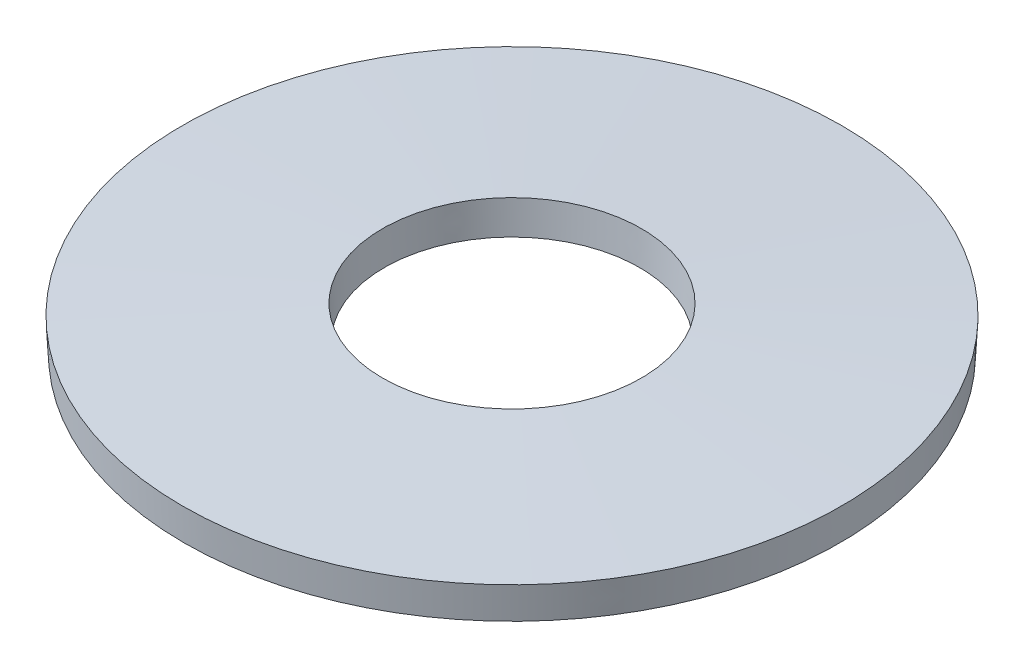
ISO-10303-21;
HEADER;
FILE_DESCRIPTION(('STEP AP214'),'2;1');
FILE_NAME('part.step','',(''),(''),'','','');
FILE_SCHEMA(('AUTOMOTIVE_DESIGN { 1 0 10303 214 1 1 1 1 }'));
ENDSEC;
DATA;
#1=APPLICATION_CONTEXT('core data for automotive mechanical design processes');
#2=APPLICATION_PROTOCOL_DEFINITION('international standard','automotive_design',2000,#1);
#3=PRODUCT_CONTEXT('',#1,'mechanical');
#4=PRODUCT('Part','Part','',(#3));
#5=PRODUCT_RELATED_PRODUCT_CATEGORY('part','',(#4));
#6=PRODUCT_DEFINITION_FORMATION('','',#4);
#7=PRODUCT_DEFINITION_CONTEXT('part definition',#1,'design');
#8=PRODUCT_DEFINITION('design','',#6,#7);
#9=PRODUCT_DEFINITION_SHAPE('','',#8);
#10=(LENGTH_UNIT() NAMED_UNIT(*) SI_UNIT(.MILLI.,.METRE.));
#11=(NAMED_UNIT(*) PLANE_ANGLE_UNIT() SI_UNIT($,.RADIAN.));
#12=(NAMED_UNIT(*) SI_UNIT($,.STERADIAN.) SOLID_ANGLE_UNIT());
#13=UNCERTAINTY_MEASURE_WITH_UNIT(LENGTH_MEASURE(1.E-05),#10,'distance_accuracy_value','');
#14=(GEOMETRIC_REPRESENTATION_CONTEXT(3) GLOBAL_UNCERTAINTY_ASSIGNED_CONTEXT((#13)) GLOBAL_UNIT_ASSIGNED_CONTEXT((#10,
#11,#12)) REPRESENTATION_CONTEXT('',''));
#15=CARTESIAN_POINT('',(0.,0.,0.));
#16=DIRECTION('',(0.,0.,1.));
#17=DIRECTION('',(1.,0.,0.));
#18=AXIS2_PLACEMENT_3D('',#15,#16,#17);
#19=CARTESIAN_POINT('',(0.,3.99423050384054,0.));
#20=DIRECTION('',(0.,1.,0.));
#21=DIRECTION('',(0.,0.,1.));
#22=AXIS2_PLACEMENT_3D('',#19,#20,#21);
#23=CONICAL_SURFACE('',#22,40.,0.0537163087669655);
#24=CARTESIAN_POINT('',(0.,0.,0.));
#25=DIRECTION('',(0.,1.,0.));
#26=DIRECTION('',(0.,0.,1.));
#27=AXIS2_PLACEMENT_3D('',#24,#25,#26);
#28=CIRCLE('',#27,39.785238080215);
#29=CARTESIAN_POINT('',(0.,0.,39.785238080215));
#30=VERTEX_POINT('',#29);
#31=EDGE_CURVE('E29',#30,#30,#28,.T.);
#32=ORIENTED_EDGE('',*,*,#31,.T.);
#33=EDGE_LOOP('',(#32));
#34=FACE_BOUND('',#33,.T.);
#35=CARTESIAN_POINT('',(0.,3.99423050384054,0.));
#36=DIRECTION('',(0.,1.,0.));
#37=DIRECTION('',(0.,0.,1.));
#38=AXIS2_PLACEMENT_3D('',#35,#36,#37);
#39=CIRCLE('',#38,40.);
#40=CARTESIAN_POINT('',(0.,3.99423050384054,40.));
#41=VERTEX_POINT('',#40);
#42=EDGE_CURVE('E10',#41,#41,#39,.T.);
#43=ORIENTED_EDGE('',*,*,#42,.F.);
#44=EDGE_LOOP('',(#43));
#45=FACE_BOUND('',#44,.T.);
#46=ADVANCED_FACE('F15',(#34,#45),#23,.T.);
#47=CARTESIAN_POINT('',(0.,5.3,0.));
#48=DIRECTION('',(0.,-1.,0.));
#49=DIRECTION('',(0.,0.,-1.));
#50=AXIS2_PLACEMENT_3D('',#47,#48,#49);
#51=CONICAL_SURFACE('',#50,15.7147619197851,1.51708001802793);
#52=ORIENTED_EDGE('',*,*,#42,.T.);
#53=EDGE_LOOP('',(#52));
#54=FACE_BOUND('',#53,.T.);
#55=CARTESIAN_POINT('',(0.,5.3,0.));
#56=DIRECTION('',(0.,1.,0.));
#57=DIRECTION('',(0.,0.,1.));
#58=AXIS2_PLACEMENT_3D('',#55,#56,#57);
#59=CIRCLE('',#58,15.7147619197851);
#60=CARTESIAN_POINT('',(0.,5.3,15.7147619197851));
#61=VERTEX_POINT('',#60);
#62=EDGE_CURVE('E21',#61,#61,#59,.T.);
#63=ORIENTED_EDGE('',*,*,#62,.F.);
#64=EDGE_LOOP('',(#63));
#65=FACE_BOUND('',#64,.T.);
#66=ADVANCED_FACE('F47',(#54,#65),#51,.T.);
#67=CARTESIAN_POINT('',(0.,1.30576949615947,0.));
#68=DIRECTION('',(0.,1.,0.));
#69=DIRECTION('',(0.,0.,1.));
#70=AXIS2_PLACEMENT_3D('',#67,#68,#69);
#71=CONICAL_SURFACE('',#70,15.5,0.0537163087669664);
#72=ORIENTED_EDGE('',*,*,#62,.T.);
#73=EDGE_LOOP('',(#72));
#74=FACE_BOUND('',#73,.T.);
#75=CARTESIAN_POINT('',(0.,1.30576949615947,0.));
#76=DIRECTION('',(0.,1.,0.));
#77=DIRECTION('',(0.,0.,1.));
#78=AXIS2_PLACEMENT_3D('',#75,#76,#77);
#79=CIRCLE('',#78,15.5);
#80=CARTESIAN_POINT('',(0.,1.30576949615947,15.5));
#81=VERTEX_POINT('',#80);
#82=EDGE_CURVE('E25',#81,#81,#79,.T.);
#83=ORIENTED_EDGE('',*,*,#82,.F.);
#84=EDGE_LOOP('',(#83));
#85=FACE_BOUND('',#84,.T.);
#86=ADVANCED_FACE('F39',(#74,#85),#71,.F.);
#87=CARTESIAN_POINT('',(0.,0.,0.));
#88=DIRECTION('',(0.,-1.,0.));
#89=DIRECTION('',(0.,0.,-1.));
#90=AXIS2_PLACEMENT_3D('',#87,#88,#89);
#91=CONICAL_SURFACE('',#90,39.785238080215,1.51708001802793);
#92=ORIENTED_EDGE('',*,*,#82,.T.);
#93=EDGE_LOOP('',(#92));
#94=FACE_BOUND('',#93,.T.);
#95=ORIENTED_EDGE('',*,*,#31,.F.);
#96=EDGE_LOOP('',(#95));
#97=FACE_BOUND('',#96,.T.);
#98=ADVANCED_FACE('F37',(#94,#97),#91,.F.);
#99=CLOSED_SHELL('',(#46,#66,#86,#98));
#100=MANIFOLD_SOLID_BREP('B1',#99);
#101=ADVANCED_BREP_SHAPE_REPRESENTATION('',(#18,#100),#14);
#102=SHAPE_DEFINITION_REPRESENTATION(#9,#101);
ENDSEC;
END-ISO-10303-21;
